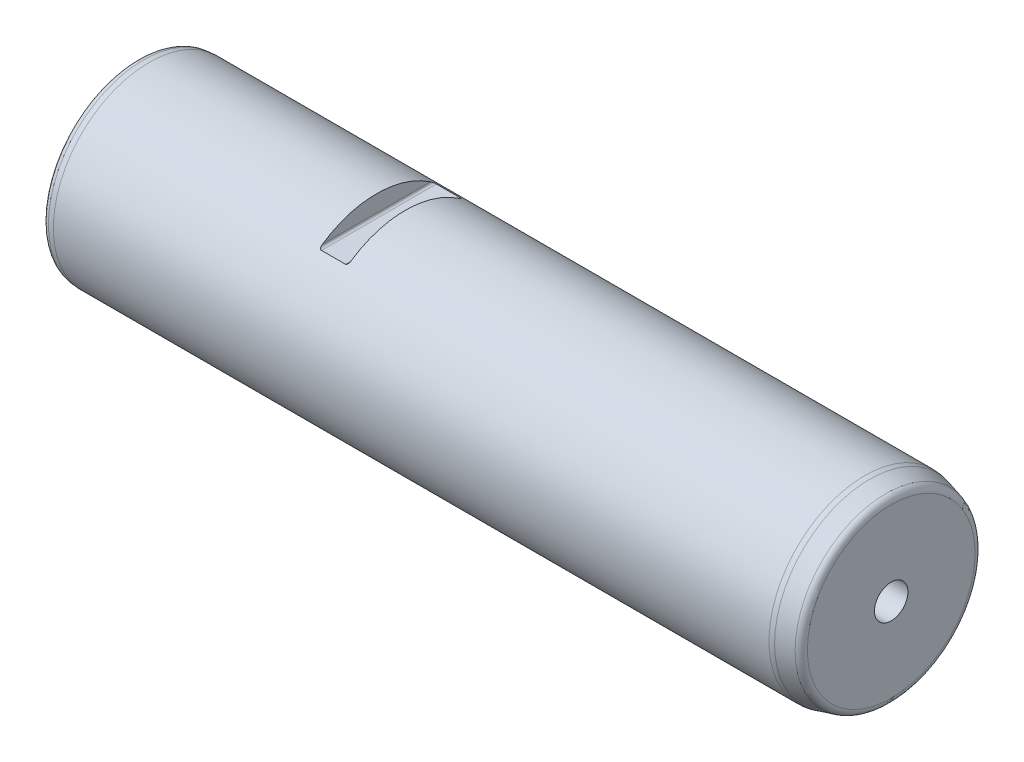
ISO-10303-21;
HEADER;
FILE_DESCRIPTION(('STEP AP214'),'2;1');
FILE_NAME('part.step','',(''),(''),'','','');
FILE_SCHEMA(('AUTOMOTIVE_DESIGN { 1 0 10303 214 1 1 1 1 }'));
ENDSEC;
DATA;
#1=APPLICATION_CONTEXT('core data for automotive mechanical design processes');
#2=APPLICATION_PROTOCOL_DEFINITION('international standard','automotive_design',2000,#1);
#3=PRODUCT_CONTEXT('',#1,'mechanical');
#4=PRODUCT('Part','Part','',(#3));
#5=PRODUCT_RELATED_PRODUCT_CATEGORY('part','',(#4));
#6=PRODUCT_DEFINITION_FORMATION('','',#4);
#7=PRODUCT_DEFINITION_CONTEXT('part definition',#1,'design');
#8=PRODUCT_DEFINITION('design','',#6,#7);
#9=PRODUCT_DEFINITION_SHAPE('','',#8);
#10=(LENGTH_UNIT() NAMED_UNIT(*) SI_UNIT(.MILLI.,.METRE.));
#11=(NAMED_UNIT(*) PLANE_ANGLE_UNIT() SI_UNIT($,.RADIAN.));
#12=(NAMED_UNIT(*) SI_UNIT($,.STERADIAN.) SOLID_ANGLE_UNIT());
#13=UNCERTAINTY_MEASURE_WITH_UNIT(LENGTH_MEASURE(1.E-05),#10,'distance_accuracy_value','');
#14=(GEOMETRIC_REPRESENTATION_CONTEXT(3) GLOBAL_UNCERTAINTY_ASSIGNED_CONTEXT((#13)) GLOBAL_UNIT_ASSIGNED_CONTEXT((#10,
#11,#12)) REPRESENTATION_CONTEXT('',''));
#15=CARTESIAN_POINT('',(0.,0.,0.));
#16=DIRECTION('',(0.,0.,1.));
#17=DIRECTION('',(1.,0.,0.));
#18=AXIS2_PLACEMENT_3D('',#15,#16,#17);
#19=CARTESIAN_POINT('',(0.,0.,0.));
#20=DIRECTION('',(1.,0.,0.));
#21=DIRECTION('',(0.,0.,-1.));
#22=AXIS2_PLACEMENT_3D('',#19,#20,#21);
#23=PLANE('',#22);
#24=CARTESIAN_POINT('',(0.,0.,0.));
#25=DIRECTION('',(1.,0.,0.));
#26=DIRECTION('',(0.,0.,-1.));
#27=AXIS2_PLACEMENT_3D('',#24,#25,#26);
#28=CIRCLE('',#27,36.8135631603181);
#29=CARTESIAN_POINT('',(0.,0.,-36.8135631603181));
#30=VERTEX_POINT('',#29);
#31=EDGE_CURVE('E158',#30,#30,#28,.F.);
#32=ORIENTED_EDGE('',*,*,#31,.T.);
#33=EDGE_LOOP('',(#32));
#34=FACE_BOUND('',#33,.T.);
#35=ADVANCED_FACE('F15',(#34),#23,.F.);
#36=CARTESIAN_POINT('',(0.,0.,0.));
#37=DIRECTION('',(-1.,0.,0.));
#38=DIRECTION('',(0.,0.,1.));
#39=AXIS2_PLACEMENT_3D('',#36,#37,#38);
#40=CYLINDRICAL_SURFACE('',#39,40.);
#41=CARTESIAN_POINT('',(112.,0.,0.));
#42=DIRECTION('',(1.,0.,0.));
#43=DIRECTION('',(0.,1.,0.));
#44=AXIS2_PLACEMENT_3D('',#41,#42,#43);
#45=CIRCLE('',#44,40.);
#46=CARTESIAN_POINT('',(112.,33.,-22.6053091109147));
#47=VERTEX_POINT('',#46);
#48=CARTESIAN_POINT('',(112.,33.,22.6053091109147));
#49=VERTEX_POINT('',#48);
#50=EDGE_CURVE('E9',#47,#49,#45,.T.);
#51=ORIENTED_EDGE('',*,*,#50,.T.);
#52=CARTESIAN_POINT('',(112.,33.,22.6053091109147));
#53=CARTESIAN_POINT('',(111.999956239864,32.9533062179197,22.6734793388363));
#54=CARTESIAN_POINT('',(111.996724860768,32.9063709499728,22.7415390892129));
#55=CARTESIAN_POINT('',(111.9833741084,32.8121892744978,22.8772162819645));
#56=CARTESIAN_POINT('',(111.973223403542,32.764942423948,22.9448302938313));
#57=CARTESIAN_POINT('',(111.945383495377,32.6703030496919,23.0793877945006));
#58=CARTESIAN_POINT('',(111.927624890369,32.6229132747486,23.1463191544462));
#59=CARTESIAN_POINT('',(111.883718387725,32.5291271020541,23.277937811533));
#60=CARTESIAN_POINT('',(111.857588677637,32.4827287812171,23.3426296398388));
#61=CARTESIAN_POINT('',(111.802378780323,32.4016320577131,23.4550198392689));
#62=CARTESIAN_POINT('',(111.77516014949,32.3665742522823,23.5033665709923));
#63=CARTESIAN_POINT('',(111.713954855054,32.2983090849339,23.5970884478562));
#64=CARTESIAN_POINT('',(111.679967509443,32.2651019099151,23.6424632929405));
#65=CARTESIAN_POINT('',(111.603736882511,32.201241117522,23.7293702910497));
#66=CARTESIAN_POINT('',(111.561384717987,32.1706297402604,23.7708397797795));
#67=CARTESIAN_POINT('',(111.467801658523,32.1145012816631,23.8466142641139));
#68=CARTESIAN_POINT('',(111.416609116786,32.0889631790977,23.8809488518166));
#69=CARTESIAN_POINT('',(111.329466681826,32.0552261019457,23.9261971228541));
#70=CARTESIAN_POINT('',(111.29649313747,32.0443038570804,23.9408193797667));
#71=CARTESIAN_POINT('',(111.228097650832,32.0257208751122,23.9656721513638));
#72=CARTESIAN_POINT('',(111.192682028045,32.0180520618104,23.9759135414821));
#73=CARTESIAN_POINT('',(111.130975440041,32.0082798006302,23.9889572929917));
#74=CARTESIAN_POINT('',(111.10511035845,32.0051988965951,23.9930670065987));
#75=CARTESIAN_POINT('',(111.05284071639,32.0010479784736,23.998602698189));
#76=CARTESIAN_POINT('',(111.026434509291,31.9999854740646,24.0000186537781));
#77=CARTESIAN_POINT('',(111.,32.,24.));
#78=B_SPLINE_CURVE_WITH_KNOTS('',3,(#52,#53,#54,#55,#56,#57,#58,#59,#60,#61,#62,#63,#64,#65,#66,
#67,#68,#69,#70,#71,#72,#73,#74,#75,#76,#77),.UNSPECIFIED.,.F.,.F.,(4,2,2,2,2,2,2,2,2,2,2,2,4),
(0.,0.247894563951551,0.496919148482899,0.748265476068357,0.999069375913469,1.19560905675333,
1.39216855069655,1.59147884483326,1.78994522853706,1.90262338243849,2.01502016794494,
2.09392287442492,2.17311857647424),.UNSPECIFIED.);
#79=CARTESIAN_POINT('',(111.,32.,24.));
#80=VERTEX_POINT('',#79);
#81=EDGE_CURVE('E23',#49,#80,#78,.T.);
#82=ORIENTED_EDGE('',*,*,#81,.T.);
#83=DIRECTION('',(-1.,0.,0.));
#84=VECTOR('',#83,1.);
#85=CARTESIAN_POINT('',(0.,32.,24.));
#86=LINE('',#85,#84);
#87=CARTESIAN_POINT('',(101.,32.,24.));
#88=VERTEX_POINT('',#87);
#89=EDGE_CURVE('E72',#80,#88,#86,.T.);
#90=ORIENTED_EDGE('',*,*,#89,.T.);
#91=CARTESIAN_POINT('',(101.,32.,24.));
#92=CARTESIAN_POINT('',(100.979515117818,31.9999961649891,24.0000048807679));
#93=CARTESIAN_POINT('',(100.959045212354,32.0006300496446,23.9991599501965));
#94=CARTESIAN_POINT('',(100.918340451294,32.0031320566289,23.9958234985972));
#95=CARTESIAN_POINT('',(100.898105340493,32.0049986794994,23.9933339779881));
#96=CARTESIAN_POINT('',(100.838485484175,32.0123267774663,23.9835569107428));
#97=CARTESIAN_POINT('',(100.799665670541,32.0195187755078,23.9739578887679));
#98=CARTESIAN_POINT('',(100.724972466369,32.0377946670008,23.949528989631));
#99=CARTESIAN_POINT('',(100.689086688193,32.048861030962,23.9347226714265));
#100=CARTESIAN_POINT('',(100.620448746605,32.0741044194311,23.9008843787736));
#101=CARTESIAN_POINT('',(100.587706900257,32.0882912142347,23.8818391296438));
#102=CARTESIAN_POINT('',(100.50892843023,32.1272536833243,23.8294171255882));
#103=CARTESIAN_POINT('',(100.46516671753,32.1536303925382,23.7938287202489));
#104=CARTESIAN_POINT('',(100.38502670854,32.209926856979,23.7175646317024));
#105=CARTESIAN_POINT('',(100.34866354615,32.2398536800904,23.6768787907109));
#106=CARTESIAN_POINT('',(100.288885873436,32.2959720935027,23.6002540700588));
#107=CARTESIAN_POINT('',(100.264326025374,32.3217752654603,23.5649069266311));
#108=CARTESIAN_POINT('',(100.219071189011,32.3744164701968,23.4925343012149));
#109=CARTESIAN_POINT('',(100.198378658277,32.4012551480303,23.4555077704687));
#110=CARTESIAN_POINT('',(100.141431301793,32.4829971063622,23.3423121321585));
#111=CARTESIAN_POINT('',(100.110455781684,32.5389782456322,23.2642288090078));
#112=CARTESIAN_POINT('',(100.07059809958,32.6291137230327,23.1375093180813));
#113=CARTESIAN_POINT('',(100.057848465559,32.662928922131,23.0897499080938));
#114=CARTESIAN_POINT('',(100.036262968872,32.7307800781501,22.9934663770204));
#115=CARTESIAN_POINT('',(100.027428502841,32.7648161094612,22.9449419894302));
#116=CARTESIAN_POINT('',(100.013537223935,32.832462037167,22.8480389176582));
#117=CARTESIAN_POINT('',(100.008432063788,32.8660716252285,22.7996667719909));
#118=CARTESIAN_POINT('',(100.001670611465,32.9331582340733,22.7026556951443));
#119=CARTESIAN_POINT('',(100.000011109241,32.9666353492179,22.6540170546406));
#120=CARTESIAN_POINT('',(100.,33.,22.6053091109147));
#121=B_SPLINE_CURVE_WITH_KNOTS('',3,(#91,#92,#93,#94,#95,#96,#97,#98,#99,#100,#101,#102,#103,
#104,#105,#106,#107,#108,#109,#110,#111,#112,#113,#114,#115,#116,#117,#118,#119,#120),
.UNSPECIFIED.,.F.,.F.,(4,2,2,2,2,2,2,2,2,2,2,2,2,2,4),(0.,0.0613996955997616,0.12272484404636,
0.243841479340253,0.364417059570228,0.485375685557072,0.671136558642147,0.857273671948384,
1.00761587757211,1.15805329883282,1.45979260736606,1.63937001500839,1.81901143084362,
1.9962804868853,2.17338432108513),.UNSPECIFIED.);
#122=CARTESIAN_POINT('',(100.,33.,22.6053091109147));
#123=VERTEX_POINT('',#122);
#124=EDGE_CURVE('E64',#88,#123,#121,.T.);
#125=ORIENTED_EDGE('',*,*,#124,.T.);
#126=CARTESIAN_POINT('',(100.,0.,0.));
#127=DIRECTION('',(-1.,0.,0.));
#128=DIRECTION('',(0.,-1.,0.));
#129=AXIS2_PLACEMENT_3D('',#126,#127,#128);
#130=CIRCLE('',#129,40.);
#131=CARTESIAN_POINT('',(100.,33.,-22.6053091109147));
#132=VERTEX_POINT('',#131);
#133=EDGE_CURVE('E53',#123,#132,#130,.T.);
#134=ORIENTED_EDGE('',*,*,#133,.T.);
#135=CARTESIAN_POINT('',(100.,33.,-22.6053091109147));
#136=CARTESIAN_POINT('',(100.000043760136,32.9533062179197,-22.6734793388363));
#137=CARTESIAN_POINT('',(100.003275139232,32.9063709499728,-22.7415390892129));
#138=CARTESIAN_POINT('',(100.0166258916,32.8121892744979,-22.8772162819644));
#139=CARTESIAN_POINT('',(100.026776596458,32.764942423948,-22.9448302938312));
#140=CARTESIAN_POINT('',(100.054616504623,32.670303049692,-23.0793877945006));
#141=CARTESIAN_POINT('',(100.072375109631,32.6229132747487,-23.1463191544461));
#142=CARTESIAN_POINT('',(100.116281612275,32.5291271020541,-23.277937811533));
#143=CARTESIAN_POINT('',(100.142411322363,32.4827287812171,-23.3426296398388));
#144=CARTESIAN_POINT('',(100.197621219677,32.4016320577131,-23.4550198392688));
#145=CARTESIAN_POINT('',(100.22483985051,32.3665742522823,-23.5033665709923));
#146=CARTESIAN_POINT('',(100.286045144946,32.2983090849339,-23.5970884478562));
#147=CARTESIAN_POINT('',(100.320032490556,32.2651019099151,-23.6424632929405));
#148=CARTESIAN_POINT('',(100.396263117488,32.201241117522,-23.7293702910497));
#149=CARTESIAN_POINT('',(100.438615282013,32.1706297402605,-23.7708397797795));
#150=CARTESIAN_POINT('',(100.532198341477,32.1145012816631,-23.8466142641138));
#151=CARTESIAN_POINT('',(100.583390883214,32.0889631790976,-23.8809488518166));
#152=CARTESIAN_POINT('',(100.670533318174,32.0552261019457,-23.9261971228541));
#153=CARTESIAN_POINT('',(100.70350686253,32.0443038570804,-23.9408193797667));
#154=CARTESIAN_POINT('',(100.771902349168,32.0257208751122,-23.9656721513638));
#155=CARTESIAN_POINT('',(100.807317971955,32.0180520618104,-23.9759135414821));
#156=CARTESIAN_POINT('',(100.869024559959,32.0082798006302,-23.9889572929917));
#157=CARTESIAN_POINT('',(100.89488964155,32.0051988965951,-23.9930670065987));
#158=CARTESIAN_POINT('',(100.94715928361,32.0010479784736,-23.998602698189));
#159=CARTESIAN_POINT('',(100.973565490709,31.9999854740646,-24.0000186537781));
#160=CARTESIAN_POINT('',(101.,32.,-24.));
#161=B_SPLINE_CURVE_WITH_KNOTS('',3,(#135,#136,#137,#138,#139,#140,#141,#142,#143,#144,#145,
#146,#147,#148,#149,#150,#151,#152,#153,#154,#155,#156,#157,#158,#159,#160),.UNSPECIFIED.,.F.,
.F.,(4,2,2,2,2,2,2,2,2,2,2,2,4),(0.,0.247894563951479,0.496919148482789,0.748265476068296,
0.999069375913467,1.19560905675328,1.39216855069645,1.59147884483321,1.7899452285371,
1.90262338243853,2.01502016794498,2.09392287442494,2.17311857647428),.UNSPECIFIED.);
#162=CARTESIAN_POINT('',(101.,32.,-24.));
#163=VERTEX_POINT('',#162);
#164=EDGE_CURVE('E58',#132,#163,#161,.T.);
#165=ORIENTED_EDGE('',*,*,#164,.T.);
#166=DIRECTION('',(-1.,0.,0.));
#167=VECTOR('',#166,1.);
#168=CARTESIAN_POINT('',(0.,32.,-24.));
#169=LINE('',#168,#167);
#170=CARTESIAN_POINT('',(111.,32.,-24.));
#171=VERTEX_POINT('',#170);
#172=EDGE_CURVE('E73',#163,#171,#169,.F.);
#173=ORIENTED_EDGE('',*,*,#172,.T.);
#174=CARTESIAN_POINT('',(111.,32.,-24.));
#175=CARTESIAN_POINT('',(111.020484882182,31.9999961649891,-24.0000048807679));
#176=CARTESIAN_POINT('',(111.040954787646,32.0006300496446,-23.9991599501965));
#177=CARTESIAN_POINT('',(111.081659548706,32.0031320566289,-23.9958234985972));
#178=CARTESIAN_POINT('',(111.101894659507,32.0049986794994,-23.9933339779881));
#179=CARTESIAN_POINT('',(111.161514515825,32.0123267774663,-23.9835569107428));
#180=CARTESIAN_POINT('',(111.200334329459,32.0195187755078,-23.9739578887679));
#181=CARTESIAN_POINT('',(111.275027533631,32.0377946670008,-23.949528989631));
#182=CARTESIAN_POINT('',(111.310913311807,32.048861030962,-23.9347226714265));
#183=CARTESIAN_POINT('',(111.379551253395,32.0741044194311,-23.9008843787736));
#184=CARTESIAN_POINT('',(111.412293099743,32.0882912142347,-23.8818391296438));
#185=CARTESIAN_POINT('',(111.49107156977,32.1272536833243,-23.8294171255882));
#186=CARTESIAN_POINT('',(111.53483328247,32.1536303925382,-23.7938287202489));
#187=CARTESIAN_POINT('',(111.61497329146,32.209926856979,-23.7175646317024));
#188=CARTESIAN_POINT('',(111.65133645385,32.2398536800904,-23.6768787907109));
#189=CARTESIAN_POINT('',(111.711114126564,32.2959720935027,-23.6002540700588));
#190=CARTESIAN_POINT('',(111.735673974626,32.3217752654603,-23.5649069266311));
#191=CARTESIAN_POINT('',(111.780928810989,32.3744164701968,-23.492534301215));
#192=CARTESIAN_POINT('',(111.801621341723,32.4012551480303,-23.4555077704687));
#193=CARTESIAN_POINT('',(111.858568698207,32.4829971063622,-23.3423121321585));
#194=CARTESIAN_POINT('',(111.889544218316,32.5389782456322,-23.2642288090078));
#195=CARTESIAN_POINT('',(111.92940190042,32.6291137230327,-23.1375093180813));
#196=CARTESIAN_POINT('',(111.942151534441,32.662928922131,-23.0897499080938));
#197=CARTESIAN_POINT('',(111.963737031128,32.7307800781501,-22.9934663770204));
#198=CARTESIAN_POINT('',(111.972571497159,32.7648161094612,-22.9449419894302));
#199=CARTESIAN_POINT('',(111.986462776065,32.832462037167,-22.8480389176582));
#200=CARTESIAN_POINT('',(111.991567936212,32.8660716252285,-22.7996667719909));
#201=CARTESIAN_POINT('',(111.998329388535,32.9331582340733,-22.7026556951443));
#202=CARTESIAN_POINT('',(111.999988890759,32.9666353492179,-22.6540170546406));
#203=CARTESIAN_POINT('',(112.,33.,-22.6053091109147));
#204=B_SPLINE_CURVE_WITH_KNOTS('',3,(#174,#175,#176,#177,#178,#179,#180,#181,#182,#183,#184,
#185,#186,#187,#188,#189,#190,#191,#192,#193,#194,#195,#196,#197,#198,#199,#200,#201,#202,#203),
.UNSPECIFIED.,.F.,.F.,(4,2,2,2,2,2,2,2,2,2,2,2,2,2,4),(0.,0.0613996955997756,0.122724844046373,
0.243841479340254,0.364417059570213,0.485375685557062,0.671136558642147,0.857273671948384,
1.00761587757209,1.15805329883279,1.45979260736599,1.63937001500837,1.81901143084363,
1.99628048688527,2.17338432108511),.UNSPECIFIED.);
#205=EDGE_CURVE('E207',#171,#47,#204,.T.);
#206=ORIENTED_EDGE('',*,*,#205,.T.);
#207=EDGE_LOOP('',(#51,#82,#90,#125,#134,#165,#173,#206));
#208=FACE_BOUND('',#207,.T.);
#209=CARTESIAN_POINT('',(5.00000000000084,0.,0.));
#210=DIRECTION('',(1.,0.,0.));
#211=DIRECTION('',(0.,0.,-1.));
#212=AXIS2_PLACEMENT_3D('',#209,#210,#211);
#213=CIRCLE('',#212,40.);
#214=CARTESIAN_POINT('',(5.00000000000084,0.,-40.));
#215=VERTEX_POINT('',#214);
#216=EDGE_CURVE('E157',#215,#215,#213,.T.);
#217=ORIENTED_EDGE('',*,*,#216,.T.);
#218=EDGE_LOOP('',(#217));
#219=FACE_BOUND('',#218,.T.);
#220=CARTESIAN_POINT('',(303.946780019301,0.,0.));
#221=DIRECTION('',(1.,0.,0.));
#222=DIRECTION('',(0.,0.,-1.));
#223=AXIS2_PLACEMENT_3D('',#220,#221,#222);
#224=CIRCLE('',#223,40.);
#225=CARTESIAN_POINT('',(303.946780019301,0.,-40.));
#226=VERTEX_POINT('',#225);
#227=EDGE_CURVE('E175',#226,#226,#224,.F.);
#228=ORIENTED_EDGE('',*,*,#227,.T.);
#229=EDGE_LOOP('',(#228));
#230=FACE_BOUND('',#229,.T.);
#231=ADVANCED_FACE('F69',(#208,#219,#230),#40,.T.);
#232=CARTESIAN_POINT('',(315.,0.,0.));
#233=DIRECTION('',(-1.,0.,0.));
#234=DIRECTION('',(0.,0.,1.));
#235=AXIS2_PLACEMENT_3D('',#232,#233,#234);
#236=CONICAL_SURFACE('',#235,37.3205080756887,0.26179938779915);
#237=CARTESIAN_POINT('',(312.776457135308,0.,0.));
#238=DIRECTION('',(1.,0.,0.));
#239=DIRECTION('',(0.,0.,-1.));
#240=AXIS2_PLACEMENT_3D('',#237,#238,#239);
#241=CIRCLE('',#240,37.916304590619);
#242=CARTESIAN_POINT('',(312.776457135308,0.,-37.916304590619));
#243=VERTEX_POINT('',#242);
#244=EDGE_CURVE('E163',#243,#243,#241,.F.);
#245=ORIENTED_EDGE('',*,*,#244,.T.);
#246=EDGE_LOOP('',(#245));
#247=FACE_BOUND('',#246,.T.);
#248=CARTESIAN_POINT('',(306.017332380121,0.,0.));
#249=DIRECTION('',(1.,0.,0.));
#250=DIRECTION('',(0.,0.,-1.));
#251=AXIS2_PLACEMENT_3D('',#248,#249,#250);
#252=CIRCLE('',#251,39.7274066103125);
#253=CARTESIAN_POINT('',(306.017332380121,0.,-39.7274066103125));
#254=VERTEX_POINT('',#253);
#255=EDGE_CURVE('E188',#254,#254,#252,.T.);
#256=ORIENTED_EDGE('',*,*,#255,.T.);
#257=EDGE_LOOP('',(#256));
#258=FACE_BOUND('',#257,.T.);
#259=ADVANCED_FACE('F120',(#247,#258),#236,.T.);
#260=CARTESIAN_POINT('',(315.,37.3205080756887,0.));
#261=DIRECTION('',(-1.,0.,0.));
#262=DIRECTION('',(0.,0.,1.));
#263=AXIS2_PLACEMENT_3D('',#260,#261,#262);
#264=PLANE('',#263);
#265=CARTESIAN_POINT('',(315.,0.,0.));
#266=DIRECTION('',(1.,0.,0.));
#267=DIRECTION('',(0.,0.,-1.));
#268=AXIS2_PLACEMENT_3D('',#265,#266,#267);
#269=CIRCLE('',#268,7.);
#270=CARTESIAN_POINT('',(315.,0.,-7.));
#271=VERTEX_POINT('',#270);
#272=EDGE_CURVE('E178',#271,#271,#269,.T.);
#273=ORIENTED_EDGE('',*,*,#272,.F.);
#274=EDGE_LOOP('',(#273));
#275=FACE_BOUND('',#274,.T.);
#276=CARTESIAN_POINT('',(315.,0.,0.));
#277=DIRECTION('',(-1.,0.,0.));
#278=DIRECTION('',(0.,0.,1.));
#279=AXIS2_PLACEMENT_3D('',#276,#277,#278);
#280=CIRCLE('',#279,35.0185271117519);
#281=CARTESIAN_POINT('',(315.,0.,35.0185271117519));
#282=VERTEX_POINT('',#281);
#283=EDGE_CURVE('E159',#282,#282,#280,.F.);
#284=ORIENTED_EDGE('',*,*,#283,.T.);
#285=EDGE_LOOP('',(#284));
#286=FACE_BOUND('',#285,.T.);
#287=ADVANCED_FACE('F117',(#275,#286),#264,.F.);
#288=CARTESIAN_POINT('',(303.946780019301,0.,0.));
#289=DIRECTION('',(1.,0.,0.));
#290=DIRECTION('',(0.,0.,-1.));
#291=AXIS2_PLACEMENT_3D('',#288,#289,#290);
#292=TOROIDAL_SURFACE('',#291,32.,8.);
#293=ORIENTED_EDGE('',*,*,#255,.F.);
#294=EDGE_LOOP('',(#293));
#295=FACE_BOUND('',#294,.T.);
#296=ORIENTED_EDGE('',*,*,#227,.F.);
#297=EDGE_LOOP('',(#296));
#298=FACE_BOUND('',#297,.T.);
#299=ADVANCED_FACE('F119',(#295,#298),#292,.T.);
#300=CARTESIAN_POINT('',(312.,0.,0.));
#301=DIRECTION('',(-1.,0.,0.));
#302=DIRECTION('',(0.,0.,1.));
#303=AXIS2_PLACEMENT_3D('',#300,#301,#302);
#304=TOROIDAL_SURFACE('',#303,35.0185271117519,3.);
#305=ORIENTED_EDGE('',*,*,#283,.F.);
#306=EDGE_LOOP('',(#305));
#307=FACE_BOUND('',#306,.T.);
#308=ORIENTED_EDGE('',*,*,#244,.F.);
#309=EDGE_LOOP('',(#308));
#310=FACE_BOUND('',#309,.T.);
#311=ADVANCED_FACE('F140',(#307,#310),#304,.T.);
#312=CARTESIAN_POINT('',(0.,0.,0.));
#313=DIRECTION('',(1.,0.,0.));
#314=DIRECTION('',(0.,0.,-1.));
#315=AXIS2_PLACEMENT_3D('',#312,#313,#314);
#316=CONICAL_SURFACE('',#315,39.5625566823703,0.0872664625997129);
#317=CARTESIAN_POINT('',(2.73853277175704,0.,0.));
#318=DIRECTION('',(1.,0.,0.));
#319=DIRECTION('',(0.,0.,-1.));
#320=AXIS2_PLACEMENT_3D('',#317,#318,#319);
#321=CIRCLE('',#320,39.8021472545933);
#322=CARTESIAN_POINT('',(2.73853277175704,0.,-39.8021472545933));
#323=VERTEX_POINT('',#322);
#324=EDGE_CURVE('E59',#323,#323,#321,.T.);
#325=ORIENTED_EDGE('',*,*,#324,.T.);
#326=EDGE_LOOP('',(#325));
#327=FACE_BOUND('',#326,.T.);
#328=ORIENTED_EDGE('',*,*,#216,.F.);
#329=EDGE_LOOP('',(#328));
#330=FACE_BOUND('',#329,.T.);
#331=ADVANCED_FACE('F143',(#327,#330),#316,.T.);
#332=CARTESIAN_POINT('',(3.,0.,0.));
#333=DIRECTION('',(1.,0.,0.));
#334=DIRECTION('',(0.,0.,-1.));
#335=AXIS2_PLACEMENT_3D('',#332,#333,#334);
#336=TOROIDAL_SURFACE('',#335,36.8135631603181,3.);
#337=ORIENTED_EDGE('',*,*,#324,.F.);
#338=EDGE_LOOP('',(#337));
#339=FACE_BOUND('',#338,.T.);
#340=ORIENTED_EDGE('',*,*,#31,.F.);
#341=EDGE_LOOP('',(#340));
#342=FACE_BOUND('',#341,.T.);
#343=ADVANCED_FACE('F17',(#339,#342),#336,.T.);
#344=CARTESIAN_POINT('',(291.,0.,0.));
#345=DIRECTION('',(1.,0.,0.));
#346=DIRECTION('',(0.,0.,-1.));
#347=AXIS2_PLACEMENT_3D('',#344,#345,#346);
#348=PLANE('',#347);
#349=CARTESIAN_POINT('',(291.,0.,0.));
#350=DIRECTION('',(1.,0.,0.));
#351=DIRECTION('',(0.,0.,-1.));
#352=AXIS2_PLACEMENT_3D('',#349,#350,#351);
#353=CIRCLE('',#352,7.);
#354=CARTESIAN_POINT('',(291.,0.,-7.));
#355=VERTEX_POINT('',#354);
#356=EDGE_CURVE('E171',#355,#355,#353,.T.);
#357=ORIENTED_EDGE('',*,*,#356,.T.);
#358=EDGE_LOOP('',(#357));
#359=FACE_BOUND('',#358,.T.);
#360=CARTESIAN_POINT('',(291.,0.,0.));
#361=DIRECTION('',(1.,0.,0.));
#362=DIRECTION('',(0.,0.,-1.));
#363=AXIS2_PLACEMENT_3D('',#360,#361,#362);
#364=CIRCLE('',#363,5.1);
#365=CARTESIAN_POINT('',(291.,0.,-5.1));
#366=VERTEX_POINT('',#365);
#367=EDGE_CURVE('E168',#366,#366,#364,.F.);
#368=ORIENTED_EDGE('',*,*,#367,.T.);
#369=EDGE_LOOP('',(#368));
#370=FACE_BOUND('',#369,.T.);
#371=ADVANCED_FACE('F101',(#359,#370),#348,.T.);
#372=CARTESIAN_POINT('',(291.,0.,0.));
#373=DIRECTION('',(1.,0.,0.));
#374=DIRECTION('',(0.,0.,-1.));
#375=AXIS2_PLACEMENT_3D('',#372,#373,#374);
#376=CYLINDRICAL_SURFACE('',#375,7.);
#377=ORIENTED_EDGE('',*,*,#356,.F.);
#378=EDGE_LOOP('',(#377));
#379=FACE_BOUND('',#378,.T.);
#380=ORIENTED_EDGE('',*,*,#272,.T.);
#381=EDGE_LOOP('',(#380));
#382=FACE_BOUND('',#381,.T.);
#383=ADVANCED_FACE('F104',(#379,#382),#376,.F.);
#384=CARTESIAN_POINT('',(285.,0.,0.));
#385=DIRECTION('',(1.,0.,0.));
#386=DIRECTION('',(0.,0.,-1.));
#387=AXIS2_PLACEMENT_3D('',#384,#385,#386);
#388=CONICAL_SURFACE('',#387,5.1,1.04719755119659);
#389=CARTESIAN_POINT('',(282.055513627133,0.,0.));
#390=VERTEX_POINT('',#389);
#391=VERTEX_LOOP('',#390);
#392=FACE_BOUND('',#391,.T.);
#393=CARTESIAN_POINT('',(285.,0.,0.));
#394=DIRECTION('',(1.,0.,0.));
#395=DIRECTION('',(0.,0.,-1.));
#396=AXIS2_PLACEMENT_3D('',#393,#394,#395);
#397=CIRCLE('',#396,5.1);
#398=CARTESIAN_POINT('',(285.,0.,-5.1));
#399=VERTEX_POINT('',#398);
#400=EDGE_CURVE('E170',#399,#399,#397,.T.);
#401=ORIENTED_EDGE('',*,*,#400,.T.);
#402=EDGE_LOOP('',(#401));
#403=FACE_BOUND('',#402,.T.);
#404=ADVANCED_FACE('F108',(#392,#403),#388,.F.);
#405=CARTESIAN_POINT('',(315.,0.,0.));
#406=DIRECTION('',(1.,0.,0.));
#407=DIRECTION('',(0.,0.,-1.));
#408=AXIS2_PLACEMENT_3D('',#405,#406,#407);
#409=CYLINDRICAL_SURFACE('',#408,5.1);
#410=ORIENTED_EDGE('',*,*,#400,.F.);
#411=EDGE_LOOP('',(#410));
#412=FACE_BOUND('',#411,.T.);
#413=ORIENTED_EDGE('',*,*,#367,.F.);
#414=EDGE_LOOP('',(#413));
#415=FACE_BOUND('',#414,.T.);
#416=ADVANCED_FACE('F110',(#412,#415),#409,.F.);
#417=CARTESIAN_POINT('',(112.,33.,-40.));
#418=DIRECTION('',(1.,0.,0.));
#419=DIRECTION('',(0.,1.,0.));
#420=AXIS2_PLACEMENT_3D('',#417,#418,#419);
#421=PLANE('',#420);
#422=ORIENTED_EDGE('',*,*,#50,.F.);
#423=DIRECTION('',(0.,0.,1.));
#424=VECTOR('',#423,1.);
#425=CARTESIAN_POINT('',(112.,33.,-40.));
#426=LINE('',#425,#424);
#427=EDGE_CURVE('E182',#47,#49,#426,.T.);
#428=ORIENTED_EDGE('',*,*,#427,.T.);
#429=EDGE_LOOP('',(#422,#428));
#430=FACE_BOUND('',#429,.T.);
#431=ADVANCED_FACE('F113',(#430),#421,.F.);
#432=CARTESIAN_POINT('',(111.,33.,-40.));
#433=DIRECTION('',(0.,0.,1.));
#434=DIRECTION('',(1.,0.,0.));
#435=AXIS2_PLACEMENT_3D('',#432,#433,#434);
#436=CYLINDRICAL_SURFACE('',#435,1.);
#437=ORIENTED_EDGE('',*,*,#427,.F.);
#438=ORIENTED_EDGE('',*,*,#205,.F.);
#439=DIRECTION('',(0.,0.,1.));
#440=VECTOR('',#439,1.);
#441=CARTESIAN_POINT('',(111.,32.,-40.));
#442=LINE('',#441,#440);
#443=EDGE_CURVE('E197',#171,#80,#442,.T.);
#444=ORIENTED_EDGE('',*,*,#443,.T.);
#445=ORIENTED_EDGE('',*,*,#81,.F.);
#446=EDGE_LOOP('',(#437,#438,#444,#445));
#447=FACE_BOUND('',#446,.T.);
#448=ADVANCED_FACE('F206',(#447),#436,.F.);
#449=CARTESIAN_POINT('',(101.,32.,-40.));
#450=DIRECTION('',(0.,-1.,0.));
#451=DIRECTION('',(1.,0.,0.));
#452=AXIS2_PLACEMENT_3D('',#449,#450,#451);
#453=PLANE('',#452);
#454=ORIENTED_EDGE('',*,*,#443,.F.);
#455=ORIENTED_EDGE('',*,*,#172,.F.);
#456=DIRECTION('',(0.,0.,1.));
#457=VECTOR('',#456,1.);
#458=CARTESIAN_POINT('',(101.,32.,-40.));
#459=LINE('',#458,#457);
#460=EDGE_CURVE('E66',#163,#88,#459,.T.);
#461=ORIENTED_EDGE('',*,*,#460,.T.);
#462=ORIENTED_EDGE('',*,*,#89,.F.);
#463=EDGE_LOOP('',(#454,#455,#461,#462));
#464=FACE_BOUND('',#463,.T.);
#465=ADVANCED_FACE('F96',(#464),#453,.F.);
#466=CARTESIAN_POINT('',(101.,33.,-40.));
#467=DIRECTION('',(0.,0.,1.));
#468=DIRECTION('',(1.,0.,0.));
#469=AXIS2_PLACEMENT_3D('',#466,#467,#468);
#470=CYLINDRICAL_SURFACE('',#469,1.);
#471=ORIENTED_EDGE('',*,*,#460,.F.);
#472=ORIENTED_EDGE('',*,*,#164,.F.);
#473=DIRECTION('',(0.,0.,1.));
#474=VECTOR('',#473,1.);
#475=CARTESIAN_POINT('',(100.,33.,-40.));
#476=LINE('',#475,#474);
#477=EDGE_CURVE('E29',#132,#123,#476,.T.);
#478=ORIENTED_EDGE('',*,*,#477,.T.);
#479=ORIENTED_EDGE('',*,*,#124,.F.);
#480=EDGE_LOOP('',(#471,#472,#478,#479));
#481=FACE_BOUND('',#480,.T.);
#482=ADVANCED_FACE('F63',(#481),#470,.F.);
#483=CARTESIAN_POINT('',(100.,40.,-40.));
#484=DIRECTION('',(-1.,0.,0.));
#485=DIRECTION('',(0.,-1.,0.));
#486=AXIS2_PLACEMENT_3D('',#483,#484,#485);
#487=PLANE('',#486);
#488=ORIENTED_EDGE('',*,*,#477,.F.);
#489=ORIENTED_EDGE('',*,*,#133,.F.);
#490=EDGE_LOOP('',(#488,#489));
#491=FACE_BOUND('',#490,.T.);
#492=ADVANCED_FACE('F54',(#491),#487,.F.);
#493=CLOSED_SHELL('',(#35,#231,#259,#287,#299,#311,#331,#343,#371,#383,#404,#416,#431,#448,#465,
#482,#492));
#494=MANIFOLD_SOLID_BREP('B1',#493);
#495=ADVANCED_BREP_SHAPE_REPRESENTATION('',(#18,#494),#14);
#496=SHAPE_DEFINITION_REPRESENTATION(#9,#495);
ENDSEC;
END-ISO-10303-21;
